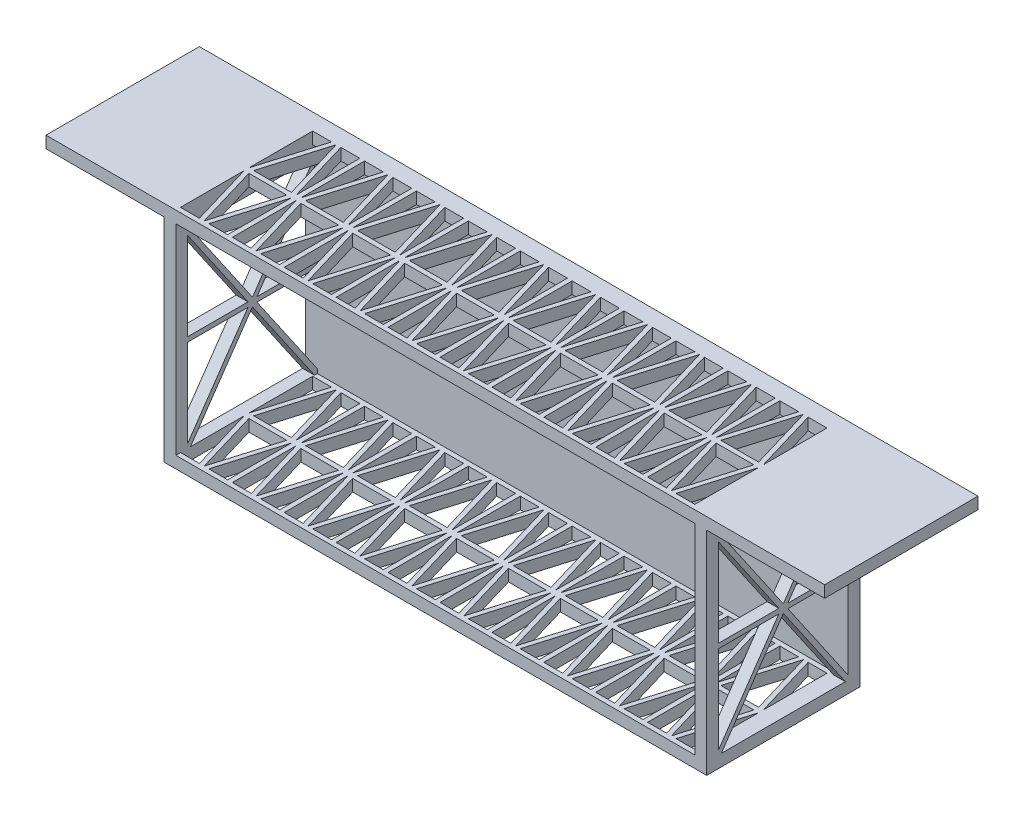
from build123d import *

# Parameters (mm, degrees)
CROQUIS1_W              = 220
CROQUIS1_H              = 85
SALIENTE_EXTRUIR1_DEPTH = 60
VACIADO1_T              = 5
CROQUIS2_W              = 65
CROQUIS2_H              = 5
SALIENTE_EXTRUIR2_DEPTH = 50
MATRIZL1_COUNT          = 2
MATRIZL1_PITCH          = 280
CORTAR_EXTRUIR8_DEPTH   = 144
MATRIZL9_COUNT          = 10
MATRIZL9_PITCH          = 22
CORTAR_EXTRUIR9_DEPTH   = 316


with BuildPart() as part:
    # Croquis1 → Saliente-Extruir1 (new body)
    with BuildSketch(Plane.XY):
        Rectangle(CROQUIS1_W, CROQUIS1_H)
    extrude(amount=SALIENTE_EXTRUIR1_DEPTH)

    # Vaciado1
    vaciado1_openings = [part.faces().sort_by_distance(p)[0] for p in [
        (0, 0, 60),
    ]]
    offset(amount=VACIADO1_T, openings=vaciado1_openings, kind=Kind.INTERSECTION)

    # Croquis2 → Saliente-Extruir2 (add)
    with BuildSketch(Plane(origin=(115, 0, 0), x_dir=(0, 0, -1), z_dir=(1, 0, 0))):
        with Locations((-27.5, 45)):
            Rectangle(CROQUIS2_W, CROQUIS2_H)
    saliente_extruir2 = extrude(amount=SALIENTE_EXTRUIR2_DEPTH)

    # MatrizL1: Saliente-Extruir2 ×2
    with Locations(*[(-i * MATRIZL1_PITCH, 0, 0) for i in range(1, MATRIZL1_COUNT)]):
        add(saliente_extruir2)

    # Croquis9 → Cortar-Extruir8 (cut)
    with BuildSketch(Plane.XZ.offset(47.5)):
        Polygon((-100, 2), (-108, 29), (-92, 29), align=None)
        Polygon((-110, 58), (-102, 58), (-110, 31), align=None)
        Polygon((-100, 58), (-108, 31), (-92, 31), align=None)
        Polygon((-90, 58), (-90, 31), (-98, 58), align=None)
        Polygon((-90, 2), (-98, 2), (-90, 29), align=None)
        Polygon((-110, 2), (-110, 29), (-102, 2), align=None)
    cortar_extruir8 = extrude(amount=-CORTAR_EXTRUIR8_DEPTH, mode=Mode.SUBTRACT)

    # MatrizL9: Cortar-Extruir8 ×10
    with Locations(*[(i * MATRIZL9_PITCH, 0, 0) for i in range(1, MATRIZL9_COUNT)]):
        add(cortar_extruir8, mode=Mode.SUBTRACT)

    # Croquis14 → Cortar-Extruir9 (cut)
    with BuildSketch(Plane(origin=(150, 0, 0), x_dir=(0, 0, -1), z_dir=(1, 0, 0))):
        Polygon((0, -1.5), (0, 35.734864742), (-25.59896951, -1.5), align=None)
        Polygon((-53.78646951, -42.5), (-1.21353049, -42.5), (-27.5, -4.265135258), align=None)
        Polygon((-55, -40.734864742), (-55, -3.5), (-29.40103049, -3.5), align=None)
        Polygon((-53.78646951, 37.5), (-1.21353049, 37.5), (-27.5, -0.734864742), align=None)
        Polygon((0, -40.734864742), (0, -3.5), (-25.59896951, -3.5), align=None)
        Polygon((-55, 35.734864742), (-29.40103049, -1.5), (-55, -1.5), align=None)
    extrude(amount=-CORTAR_EXTRUIR9_DEPTH, mode=Mode.SUBTRACT)


solid = part.part
